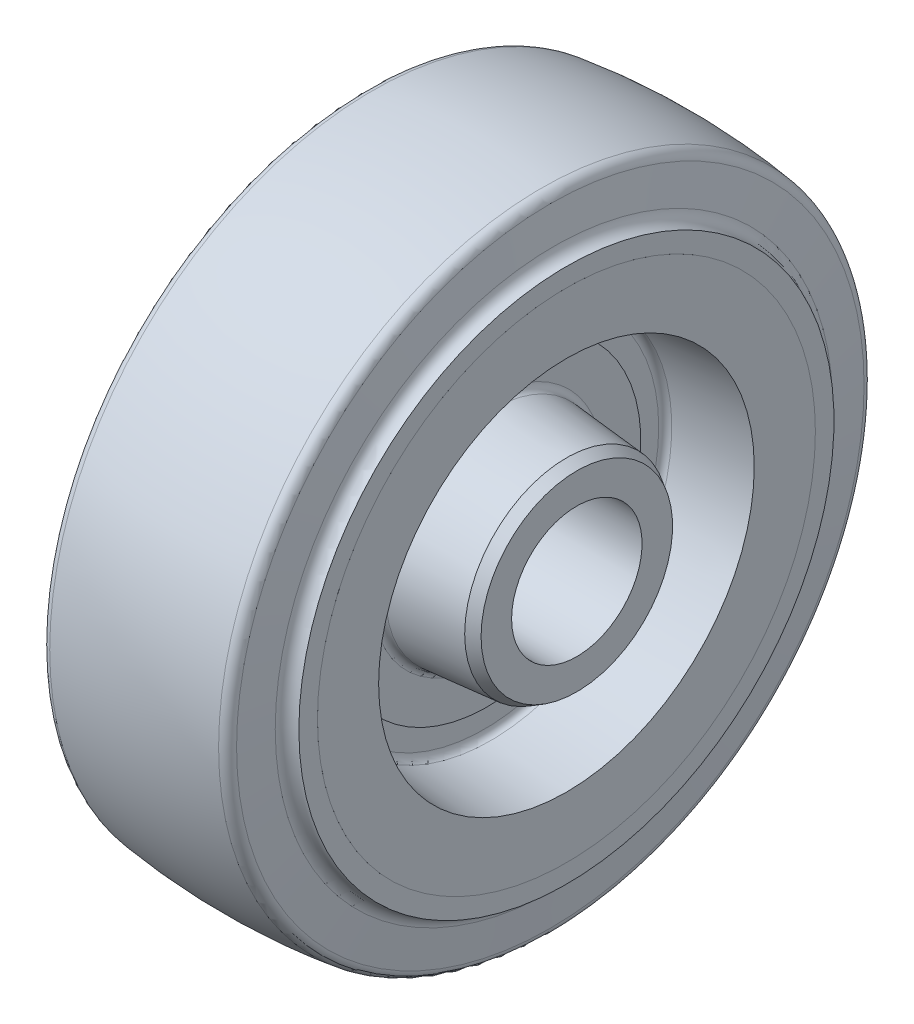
ISO-10303-21;
HEADER;
FILE_DESCRIPTION(('STEP AP214'),'2;1');
FILE_NAME('part.step','',(''),(''),'','','');
FILE_SCHEMA(('AUTOMOTIVE_DESIGN { 1 0 10303 214 1 1 1 1 }'));
ENDSEC;
DATA;
#1=APPLICATION_CONTEXT('core data for automotive mechanical design processes');
#2=APPLICATION_PROTOCOL_DEFINITION('international standard','automotive_design',2000,#1);
#3=PRODUCT_CONTEXT('',#1,'mechanical');
#4=PRODUCT('Part','Part','',(#3));
#5=PRODUCT_RELATED_PRODUCT_CATEGORY('part','',(#4));
#6=PRODUCT_DEFINITION_FORMATION('','',#4);
#7=PRODUCT_DEFINITION_CONTEXT('part definition',#1,'design');
#8=PRODUCT_DEFINITION('design','',#6,#7);
#9=PRODUCT_DEFINITION_SHAPE('','',#8);
#10=(LENGTH_UNIT() NAMED_UNIT(*) SI_UNIT(.MILLI.,.METRE.));
#11=(NAMED_UNIT(*) PLANE_ANGLE_UNIT() SI_UNIT($,.RADIAN.));
#12=(NAMED_UNIT(*) SI_UNIT($,.STERADIAN.) SOLID_ANGLE_UNIT());
#13=UNCERTAINTY_MEASURE_WITH_UNIT(LENGTH_MEASURE(1.E-05),#10,'distance_accuracy_value','');
#14=(GEOMETRIC_REPRESENTATION_CONTEXT(3) GLOBAL_UNCERTAINTY_ASSIGNED_CONTEXT((#13)) GLOBAL_UNIT_ASSIGNED_CONTEXT((#10,
#11,#12)) REPRESENTATION_CONTEXT('',''));
#15=CARTESIAN_POINT('',(0.,0.,0.));
#16=DIRECTION('',(0.,0.,1.));
#17=DIRECTION('',(1.,0.,0.));
#18=AXIS2_PLACEMENT_3D('',#15,#16,#17);
#19=CARTESIAN_POINT('',(25.4,0.,0.));
#20=DIRECTION('',(-1.,0.,0.));
#21=DIRECTION('',(0.,0.,1.));
#22=AXIS2_PLACEMENT_3D('',#19,#20,#21);
#23=CONICAL_SURFACE('',#22,23.618146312,0.0872664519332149);
#24=CARTESIAN_POINT('',(8.56114027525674,0.,0.));
#25=DIRECTION('',(-1.,0.,0.));
#26=DIRECTION('',(0.,0.,1.));
#27=AXIS2_PLACEMENT_3D('',#24,#25,#26);
#28=CIRCLE('',#27,25.0913554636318);
#29=CARTESIAN_POINT('',(8.56114027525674,0.,25.0913554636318));
#30=VERTEX_POINT('',#29);
#31=EDGE_CURVE('E10',#30,#30,#28,.T.);
#32=ORIENTED_EDGE('',*,*,#31,.F.);
#33=EDGE_LOOP('',(#32));
#34=FACE_BOUND('',#33,.T.);
#35=CARTESIAN_POINT('',(25.4,0.,0.));
#36=DIRECTION('',(-1.,0.,0.));
#37=DIRECTION('',(0.,0.,1.));
#38=AXIS2_PLACEMENT_3D('',#35,#36,#37);
#39=CIRCLE('',#38,23.618146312);
#40=CARTESIAN_POINT('',(25.4,0.,23.618146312));
#41=VERTEX_POINT('',#40);
#42=EDGE_CURVE('E460',#41,#41,#39,.T.);
#43=ORIENTED_EDGE('',*,*,#42,.T.);
#44=EDGE_LOOP('',(#43));
#45=FACE_BOUND('',#44,.T.);
#46=ADVANCED_FACE('F360',(#34,#45),#23,.T.);
#47=CARTESIAN_POINT('',(8.6995,0.,0.));
#48=DIRECTION('',(-1.,0.,0.));
#49=DIRECTION('',(0.,0.,1.));
#50=AXIS2_PLACEMENT_3D('',#47,#48,#49);
#51=TOROIDAL_SURFACE('',#50,26.6728145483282,1.5875);
#52=CARTESIAN_POINT('',(7.112,0.,0.));
#53=DIRECTION('',(-1.,0.,0.));
#54=DIRECTION('',(0.,0.,1.));
#55=AXIS2_PLACEMENT_3D('',#52,#53,#54);
#56=CIRCLE('',#55,26.6728145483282);
#57=CARTESIAN_POINT('',(7.112,0.,26.6728145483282));
#58=VERTEX_POINT('',#57);
#59=EDGE_CURVE('E366',#58,#58,#56,.T.);
#60=ORIENTED_EDGE('',*,*,#59,.F.);
#61=EDGE_LOOP('',(#60));
#62=FACE_BOUND('',#61,.T.);
#63=ORIENTED_EDGE('',*,*,#31,.T.);
#64=EDGE_LOOP('',(#63));
#65=FACE_BOUND('',#64,.T.);
#66=ADVANCED_FACE('F641',(#62,#65),#51,.F.);
#67=CARTESIAN_POINT('',(7.112,35.56,0.));
#68=DIRECTION('',(-1.,0.,0.));
#69=DIRECTION('',(0.,0.,1.));
#70=AXIS2_PLACEMENT_3D('',#67,#68,#69);
#71=PLANE('',#70);
#72=CARTESIAN_POINT('',(7.112,0.,0.));
#73=DIRECTION('',(-1.,0.,0.));
#74=DIRECTION('',(0.,0.,1.));
#75=AXIS2_PLACEMENT_3D('',#72,#73,#74);
#76=CIRCLE('',#75,35.56);
#77=CARTESIAN_POINT('',(7.112,0.,35.56));
#78=VERTEX_POINT('',#77);
#79=EDGE_CURVE('E370',#78,#78,#76,.T.);
#80=ORIENTED_EDGE('',*,*,#79,.F.);
#81=EDGE_LOOP('',(#80));
#82=FACE_BOUND('',#81,.T.);
#83=ORIENTED_EDGE('',*,*,#59,.T.);
#84=EDGE_LOOP('',(#83));
#85=FACE_BOUND('',#84,.T.);
#86=ADVANCED_FACE('F636',(#82,#85),#71,.F.);
#87=CARTESIAN_POINT('',(-38.862204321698,0.,0.));
#88=DIRECTION('',(-1.,0.,0.));
#89=DIRECTION('',(0.,0.,1.));
#90=AXIS2_PLACEMENT_3D('',#87,#88,#89);
#91=CYLINDRICAL_SURFACE('',#90,35.56);
#92=CARTESIAN_POINT('',(6.35,0.,0.));
#93=DIRECTION('',(-1.,0.,0.));
#94=DIRECTION('',(0.,0.,1.));
#95=AXIS2_PLACEMENT_3D('',#92,#93,#94);
#96=CIRCLE('',#95,35.56);
#97=CARTESIAN_POINT('',(6.35,0.,35.56));
#98=VERTEX_POINT('',#97);
#99=EDGE_CURVE('E374',#98,#98,#96,.T.);
#100=ORIENTED_EDGE('',*,*,#99,.F.);
#101=EDGE_LOOP('',(#100));
#102=FACE_BOUND('',#101,.T.);
#103=ORIENTED_EDGE('',*,*,#79,.T.);
#104=EDGE_LOOP('',(#103));
#105=FACE_BOUND('',#104,.T.);
#106=ADVANCED_FACE('F630',(#102,#105),#91,.T.);
#107=CARTESIAN_POINT('',(6.35,40.4707588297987,0.));
#108=DIRECTION('',(-1.,0.,0.));
#109=DIRECTION('',(0.,0.,1.));
#110=AXIS2_PLACEMENT_3D('',#107,#108,#109);
#111=PLANE('',#110);
#112=CARTESIAN_POINT('',(6.35,0.,0.));
#113=DIRECTION('',(-1.,0.,0.));
#114=DIRECTION('',(0.,0.,1.));
#115=AXIS2_PLACEMENT_3D('',#112,#113,#114);
#116=CIRCLE('',#115,40.4707588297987);
#117=CARTESIAN_POINT('',(6.35,0.,40.4707588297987));
#118=VERTEX_POINT('',#117);
#119=EDGE_CURVE('E379',#118,#118,#116,.T.);
#120=ORIENTED_EDGE('',*,*,#119,.F.);
#121=EDGE_LOOP('',(#120));
#122=FACE_BOUND('',#121,.T.);
#123=ORIENTED_EDGE('',*,*,#99,.T.);
#124=EDGE_LOOP('',(#123));
#125=FACE_BOUND('',#124,.T.);
#126=ADVANCED_FACE('F624',(#122,#125),#111,.F.);
#127=CARTESIAN_POINT('',(7.9375,0.,0.));
#128=DIRECTION('',(-1.,0.,0.));
#129=DIRECTION('',(0.,0.,1.));
#130=AXIS2_PLACEMENT_3D('',#127,#128,#129);
#131=TOROIDAL_SURFACE('',#130,40.4707588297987,1.5875);
#132=CARTESIAN_POINT('',(7.79914025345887,0.,0.));
#133=DIRECTION('',(-1.,0.,0.));
#134=DIRECTION('',(0.,0.,1.));
#135=AXIS2_PLACEMENT_3D('',#132,#133,#134);
#136=CIRCLE('',#135,42.0522179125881);
#137=CARTESIAN_POINT('',(7.79914025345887,0.,42.0522179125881));
#138=VERTEX_POINT('',#137);
#139=EDGE_CURVE('E382',#138,#138,#136,.T.);
#140=ORIENTED_EDGE('',*,*,#139,.F.);
#141=EDGE_LOOP('',(#140));
#142=FACE_BOUND('',#141,.T.);
#143=ORIENTED_EDGE('',*,*,#119,.T.);
#144=EDGE_LOOP('',(#143));
#145=FACE_BOUND('',#144,.T.);
#146=ADVANCED_FACE('F618',(#142,#145),#131,.F.);
#147=CARTESIAN_POINT('',(7.79914025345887,0.,0.));
#148=DIRECTION('',(1.,0.,0.));
#149=DIRECTION('',(0.,0.,-1.));
#150=AXIS2_PLACEMENT_3D('',#147,#148,#149);
#151=CONICAL_SURFACE('',#150,42.0522179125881,0.0872664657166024);
#152=CARTESIAN_POINT('',(25.4,0.,0.));
#153=DIRECTION('',(-1.,0.,0.));
#154=DIRECTION('',(0.,0.,1.));
#155=AXIS2_PLACEMENT_3D('',#152,#153,#154);
#156=CIRCLE('',#155,43.592093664);
#157=CARTESIAN_POINT('',(25.4,0.,43.592093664));
#158=VERTEX_POINT('',#157);
#159=EDGE_CURVE('E385',#158,#158,#156,.T.);
#160=ORIENTED_EDGE('',*,*,#159,.F.);
#161=EDGE_LOOP('',(#160));
#162=FACE_BOUND('',#161,.T.);
#163=ORIENTED_EDGE('',*,*,#139,.T.);
#164=EDGE_LOOP('',(#163));
#165=FACE_BOUND('',#164,.T.);
#166=ADVANCED_FACE('F612',(#162,#165),#151,.F.);
#167=CARTESIAN_POINT('',(25.4,43.592093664,0.));
#168=DIRECTION('',(-1.,0.,0.));
#169=DIRECTION('',(0.,0.,1.));
#170=AXIS2_PLACEMENT_3D('',#167,#168,#169);
#171=PLANE('',#170);
#172=CARTESIAN_POINT('',(25.4,0.,0.));
#173=DIRECTION('',(-1.,0.,0.));
#174=DIRECTION('',(0.,0.,1.));
#175=AXIS2_PLACEMENT_3D('',#172,#173,#174);
#176=CIRCLE('',#175,57.785);
#177=CARTESIAN_POINT('',(25.4,0.,57.785));
#178=VERTEX_POINT('',#177);
#179=EDGE_CURVE('E388',#178,#178,#176,.T.);
#180=ORIENTED_EDGE('',*,*,#179,.F.);
#181=EDGE_LOOP('',(#180));
#182=FACE_BOUND('',#181,.T.);
#183=ORIENTED_EDGE('',*,*,#159,.T.);
#184=EDGE_LOOP('',(#183));
#185=FACE_BOUND('',#184,.T.);
#186=ADVANCED_FACE('F606',(#182,#185),#171,.F.);
#187=CARTESIAN_POINT('',(-38.862204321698,0.,0.));
#188=DIRECTION('',(-1.,0.,0.));
#189=DIRECTION('',(0.,0.,1.));
#190=AXIS2_PLACEMENT_3D('',#187,#188,#189);
#191=CYLINDRICAL_SURFACE('',#190,57.785);
#192=CARTESIAN_POINT('',(25.39746,0.,0.));
#193=DIRECTION('',(-1.,0.,0.));
#194=DIRECTION('',(0.,0.,1.));
#195=AXIS2_PLACEMENT_3D('',#192,#193,#194);
#196=CIRCLE('',#195,57.785);
#197=CARTESIAN_POINT('',(25.39746,0.,57.785));
#198=VERTEX_POINT('',#197);
#199=EDGE_CURVE('E391',#198,#198,#196,.T.);
#200=ORIENTED_EDGE('',*,*,#199,.F.);
#201=EDGE_LOOP('',(#200));
#202=FACE_BOUND('',#201,.T.);
#203=ORIENTED_EDGE('',*,*,#179,.T.);
#204=EDGE_LOOP('',(#203));
#205=FACE_BOUND('',#204,.T.);
#206=ADVANCED_FACE('F600',(#202,#205),#191,.T.);
#207=CARTESIAN_POINT('',(25.39746,57.785,0.));
#208=DIRECTION('',(-1.,0.,0.));
#209=DIRECTION('',(0.,0.,1.));
#210=AXIS2_PLACEMENT_3D('',#207,#208,#209);
#211=PLANE('',#210);
#212=CARTESIAN_POINT('',(25.39746,0.,0.));
#213=DIRECTION('',(-1.,0.,0.));
#214=DIRECTION('',(0.,0.,1.));
#215=AXIS2_PLACEMENT_3D('',#212,#213,#214);
#216=CIRCLE('',#215,62.103);
#217=CARTESIAN_POINT('',(25.39746,0.,62.103));
#218=VERTEX_POINT('',#217);
#219=EDGE_CURVE('E394',#218,#218,#216,.T.);
#220=ORIENTED_EDGE('',*,*,#219,.F.);
#221=EDGE_LOOP('',(#220));
#222=FACE_BOUND('',#221,.T.);
#223=ORIENTED_EDGE('',*,*,#199,.T.);
#224=EDGE_LOOP('',(#223));
#225=FACE_BOUND('',#224,.T.);
#226=ADVANCED_FACE('F594',(#222,#225),#211,.F.);
#227=CARTESIAN_POINT('',(25.39746,0.,0.));
#228=DIRECTION('',(-1.,0.,0.));
#229=DIRECTION('',(0.,0.,1.));
#230=AXIS2_PLACEMENT_3D('',#227,#228,#229);
#231=TOROIDAL_SURFACE('',#230,65.0044204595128,2.90142045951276);
#232=CARTESIAN_POINT('',(22.5119338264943,0.,0.));
#233=DIRECTION('',(-1.,0.,0.));
#234=DIRECTION('',(0.,0.,1.));
#235=AXIS2_PLACEMENT_3D('',#232,#233,#234);
#236=CIRCLE('',#235,64.7011394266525);
#237=CARTESIAN_POINT('',(22.5119338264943,0.,64.7011394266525));
#238=VERTEX_POINT('',#237);
#239=EDGE_CURVE('E397',#238,#238,#236,.T.);
#240=ORIENTED_EDGE('',*,*,#239,.F.);
#241=EDGE_LOOP('',(#240));
#242=FACE_BOUND('',#241,.T.);
#243=ORIENTED_EDGE('',*,*,#219,.T.);
#244=EDGE_LOOP('',(#243));
#245=FACE_BOUND('',#244,.T.);
#246=ADVANCED_FACE('F588',(#242,#245),#231,.F.);
#247=CARTESIAN_POINT('',(22.5119338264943,0.,0.));
#248=DIRECTION('',(-1.,0.,0.));
#249=DIRECTION('',(0.,0.,1.));
#250=AXIS2_PLACEMENT_3D('',#247,#248,#249);
#251=CONICAL_SURFACE('',#250,64.7011394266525,1.46607656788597);
#252=CARTESIAN_POINT('',(21.6583679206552,0.,0.));
#253=DIRECTION('',(-1.,0.,0.));
#254=DIRECTION('',(0.,0.,1.));
#255=AXIS2_PLACEMENT_3D('',#252,#253,#254);
#256=CIRCLE('',#255,72.822276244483);
#257=CARTESIAN_POINT('',(21.6583679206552,0.,72.822276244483));
#258=VERTEX_POINT('',#257);
#259=EDGE_CURVE('E400',#258,#258,#256,.T.);
#260=ORIENTED_EDGE('',*,*,#259,.F.);
#261=EDGE_LOOP('',(#260));
#262=FACE_BOUND('',#261,.T.);
#263=ORIENTED_EDGE('',*,*,#239,.T.);
#264=EDGE_LOOP('',(#263));
#265=FACE_BOUND('',#264,.T.);
#266=ADVANCED_FACE('F582',(#262,#265),#251,.T.);
#267=CARTESIAN_POINT('',(19.2901626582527,0.,0.));
#268=DIRECTION('',(-1.,0.,0.));
#269=DIRECTION('',(0.,0.,1.));
#270=AXIS2_PLACEMENT_3D('',#267,#268,#269);
#271=TOROIDAL_SURFACE('',#270,72.5733678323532,2.38125);
#272=CARTESIAN_POINT('',(19.5963557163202,0.,0.));
#273=DIRECTION('',(-1.,0.,0.));
#274=DIRECTION('',(0.,0.,1.));
#275=AXIS2_PLACEMENT_3D('',#272,#273,#274);
#276=CIRCLE('',#275,74.9348498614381);
#277=CARTESIAN_POINT('',(19.5963557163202,0.,74.9348498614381));
#278=VERTEX_POINT('',#277);
#279=EDGE_CURVE('E403',#278,#278,#276,.T.);
#280=ORIENTED_EDGE('',*,*,#279,.F.);
#281=EDGE_LOOP('',(#280));
#282=FACE_BOUND('',#281,.T.);
#283=ORIENTED_EDGE('',*,*,#259,.T.);
#284=EDGE_LOOP('',(#283));
#285=FACE_BOUND('',#284,.T.);
#286=ADVANCED_FACE('F576',(#282,#285),#271,.T.);
#287=CARTESIAN_POINT('',(0.,0.,0.));
#288=DIRECTION('',(-1.,0.,0.));
#289=DIRECTION('',(0.,0.,1.));
#290=AXIS2_PLACEMENT_3D('',#287,#288,#289);
#291=DEGENERATE_TOROIDAL_SURFACE('',#290,76.2,152.4,.F.);
#292=CARTESIAN_POINT('',(-19.5963557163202,0.,0.));
#293=DIRECTION('',(-1.,0.,0.));
#294=DIRECTION('',(0.,0.,1.));
#295=AXIS2_PLACEMENT_3D('',#292,#293,#294);
#296=CIRCLE('',#295,74.9348498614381);
#297=CARTESIAN_POINT('',(-19.5963557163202,0.,74.9348498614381));
#298=VERTEX_POINT('',#297);
#299=EDGE_CURVE('E406',#298,#298,#296,.T.);
#300=ORIENTED_EDGE('',*,*,#299,.F.);
#301=EDGE_LOOP('',(#300));
#302=FACE_BOUND('',#301,.T.);
#303=ORIENTED_EDGE('',*,*,#279,.T.);
#304=EDGE_LOOP('',(#303));
#305=FACE_BOUND('',#304,.T.);
#306=ADVANCED_FACE('F570',(#302,#305),#291,.F.);
#307=CARTESIAN_POINT('',(-19.2901626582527,0.,0.));
#308=DIRECTION('',(-1.,0.,0.));
#309=DIRECTION('',(0.,0.,1.));
#310=AXIS2_PLACEMENT_3D('',#307,#308,#309);
#311=TOROIDAL_SURFACE('',#310,72.5733678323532,2.38124999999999);
#312=CARTESIAN_POINT('',(-21.6583679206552,0.,0.));
#313=DIRECTION('',(-1.,0.,0.));
#314=DIRECTION('',(0.,0.,1.));
#315=AXIS2_PLACEMENT_3D('',#312,#313,#314);
#316=CIRCLE('',#315,72.822276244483);
#317=CARTESIAN_POINT('',(-21.6583679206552,0.,72.822276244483));
#318=VERTEX_POINT('',#317);
#319=EDGE_CURVE('E409',#318,#318,#316,.T.);
#320=ORIENTED_EDGE('',*,*,#319,.F.);
#321=EDGE_LOOP('',(#320));
#322=FACE_BOUND('',#321,.T.);
#323=ORIENTED_EDGE('',*,*,#299,.T.);
#324=EDGE_LOOP('',(#323));
#325=FACE_BOUND('',#324,.T.);
#326=ADVANCED_FACE('F564',(#322,#325),#311,.T.);
#327=CARTESIAN_POINT('',(-21.6583679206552,0.,0.));
#328=DIRECTION('',(1.,0.,0.));
#329=DIRECTION('',(0.,0.,-1.));
#330=AXIS2_PLACEMENT_3D('',#327,#328,#329);
#331=CONICAL_SURFACE('',#330,72.822276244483,1.46607656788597);
#332=CARTESIAN_POINT('',(-22.5119338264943,0.,0.));
#333=DIRECTION('',(-1.,0.,0.));
#334=DIRECTION('',(0.,0.,1.));
#335=AXIS2_PLACEMENT_3D('',#332,#333,#334);
#336=CIRCLE('',#335,64.7011394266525);
#337=CARTESIAN_POINT('',(-22.5119338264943,0.,64.7011394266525));
#338=VERTEX_POINT('',#337);
#339=EDGE_CURVE('E412',#338,#338,#336,.T.);
#340=ORIENTED_EDGE('',*,*,#339,.F.);
#341=EDGE_LOOP('',(#340));
#342=FACE_BOUND('',#341,.T.);
#343=ORIENTED_EDGE('',*,*,#319,.T.);
#344=EDGE_LOOP('',(#343));
#345=FACE_BOUND('',#344,.T.);
#346=ADVANCED_FACE('F558',(#342,#345),#331,.T.);
#347=CARTESIAN_POINT('',(-25.39746,0.,0.));
#348=DIRECTION('',(-1.,0.,0.));
#349=DIRECTION('',(0.,0.,1.));
#350=AXIS2_PLACEMENT_3D('',#347,#348,#349);
#351=TOROIDAL_SURFACE('',#350,65.0044204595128,2.90142045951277);
#352=CARTESIAN_POINT('',(-25.39746,0.,0.));
#353=DIRECTION('',(-1.,0.,0.));
#354=DIRECTION('',(0.,0.,1.));
#355=AXIS2_PLACEMENT_3D('',#352,#353,#354);
#356=CIRCLE('',#355,62.103);
#357=CARTESIAN_POINT('',(-25.39746,0.,62.103));
#358=VERTEX_POINT('',#357);
#359=EDGE_CURVE('E415',#358,#358,#356,.T.);
#360=ORIENTED_EDGE('',*,*,#359,.F.);
#361=EDGE_LOOP('',(#360));
#362=FACE_BOUND('',#361,.T.);
#363=ORIENTED_EDGE('',*,*,#339,.T.);
#364=EDGE_LOOP('',(#363));
#365=FACE_BOUND('',#364,.T.);
#366=ADVANCED_FACE('F552',(#362,#365),#351,.F.);
#367=CARTESIAN_POINT('',(-25.39746,62.103,0.));
#368=DIRECTION('',(1.,0.,0.));
#369=DIRECTION('',(0.,0.,-1.));
#370=AXIS2_PLACEMENT_3D('',#367,#368,#369);
#371=PLANE('',#370);
#372=CARTESIAN_POINT('',(-25.39746,0.,0.));
#373=DIRECTION('',(-1.,0.,0.));
#374=DIRECTION('',(0.,0.,1.));
#375=AXIS2_PLACEMENT_3D('',#372,#373,#374);
#376=CIRCLE('',#375,57.785);
#377=CARTESIAN_POINT('',(-25.39746,0.,57.785));
#378=VERTEX_POINT('',#377);
#379=EDGE_CURVE('E418',#378,#378,#376,.T.);
#380=ORIENTED_EDGE('',*,*,#379,.F.);
#381=EDGE_LOOP('',(#380));
#382=FACE_BOUND('',#381,.T.);
#383=ORIENTED_EDGE('',*,*,#359,.T.);
#384=EDGE_LOOP('',(#383));
#385=FACE_BOUND('',#384,.T.);
#386=ADVANCED_FACE('F546',(#382,#385),#371,.F.);
#387=CARTESIAN_POINT('',(-38.862204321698,0.,0.));
#388=DIRECTION('',(-1.,0.,0.));
#389=DIRECTION('',(0.,0.,1.));
#390=AXIS2_PLACEMENT_3D('',#387,#388,#389);
#391=CYLINDRICAL_SURFACE('',#390,57.785);
#392=CARTESIAN_POINT('',(-25.4,0.,0.));
#393=DIRECTION('',(-1.,0.,0.));
#394=DIRECTION('',(0.,0.,1.));
#395=AXIS2_PLACEMENT_3D('',#392,#393,#394);
#396=CIRCLE('',#395,57.785);
#397=CARTESIAN_POINT('',(-25.4,0.,57.785));
#398=VERTEX_POINT('',#397);
#399=EDGE_CURVE('E421',#398,#398,#396,.T.);
#400=ORIENTED_EDGE('',*,*,#399,.F.);
#401=EDGE_LOOP('',(#400));
#402=FACE_BOUND('',#401,.T.);
#403=ORIENTED_EDGE('',*,*,#379,.T.);
#404=EDGE_LOOP('',(#403));
#405=FACE_BOUND('',#404,.T.);
#406=ADVANCED_FACE('F540',(#402,#405),#391,.T.);
#407=CARTESIAN_POINT('',(-25.4,57.785,0.));
#408=DIRECTION('',(1.,0.,0.));
#409=DIRECTION('',(0.,0.,-1.));
#410=AXIS2_PLACEMENT_3D('',#407,#408,#409);
#411=PLANE('',#410);
#412=CARTESIAN_POINT('',(-25.4,0.,0.));
#413=DIRECTION('',(-1.,0.,0.));
#414=DIRECTION('',(0.,0.,1.));
#415=AXIS2_PLACEMENT_3D('',#412,#413,#414);
#416=CIRCLE('',#415,43.592093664);
#417=CARTESIAN_POINT('',(-25.4,0.,43.592093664));
#418=VERTEX_POINT('',#417);
#419=EDGE_CURVE('E424',#418,#418,#416,.T.);
#420=ORIENTED_EDGE('',*,*,#419,.F.);
#421=EDGE_LOOP('',(#420));
#422=FACE_BOUND('',#421,.T.);
#423=ORIENTED_EDGE('',*,*,#399,.T.);
#424=EDGE_LOOP('',(#423));
#425=FACE_BOUND('',#424,.T.);
#426=ADVANCED_FACE('F534',(#422,#425),#411,.F.);
#427=CARTESIAN_POINT('',(-25.4,0.,0.));
#428=DIRECTION('',(-1.,0.,0.));
#429=DIRECTION('',(0.,0.,1.));
#430=AXIS2_PLACEMENT_3D('',#427,#428,#429);
#431=CONICAL_SURFACE('',#430,43.592093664,0.087266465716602);
#432=CARTESIAN_POINT('',(-7.79914025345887,0.,0.));
#433=DIRECTION('',(-1.,0.,0.));
#434=DIRECTION('',(0.,0.,1.));
#435=AXIS2_PLACEMENT_3D('',#432,#433,#434);
#436=CIRCLE('',#435,42.0522179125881);
#437=CARTESIAN_POINT('',(-7.79914025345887,0.,42.0522179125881));
#438=VERTEX_POINT('',#437);
#439=EDGE_CURVE('E427',#438,#438,#436,.T.);
#440=ORIENTED_EDGE('',*,*,#439,.F.);
#441=EDGE_LOOP('',(#440));
#442=FACE_BOUND('',#441,.T.);
#443=ORIENTED_EDGE('',*,*,#419,.T.);
#444=EDGE_LOOP('',(#443));
#445=FACE_BOUND('',#444,.T.);
#446=ADVANCED_FACE('F528',(#442,#445),#431,.F.);
#447=CARTESIAN_POINT('',(-7.9375,0.,0.));
#448=DIRECTION('',(-1.,0.,0.));
#449=DIRECTION('',(0.,0.,1.));
#450=AXIS2_PLACEMENT_3D('',#447,#448,#449);
#451=TOROIDAL_SURFACE('',#450,40.4707588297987,1.5875);
#452=CARTESIAN_POINT('',(-6.35,0.,0.));
#453=DIRECTION('',(-1.,0.,0.));
#454=DIRECTION('',(0.,0.,1.));
#455=AXIS2_PLACEMENT_3D('',#452,#453,#454);
#456=CIRCLE('',#455,40.4707588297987);
#457=CARTESIAN_POINT('',(-6.35,0.,40.4707588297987));
#458=VERTEX_POINT('',#457);
#459=EDGE_CURVE('E430',#458,#458,#456,.T.);
#460=ORIENTED_EDGE('',*,*,#459,.F.);
#461=EDGE_LOOP('',(#460));
#462=FACE_BOUND('',#461,.T.);
#463=ORIENTED_EDGE('',*,*,#439,.T.);
#464=EDGE_LOOP('',(#463));
#465=FACE_BOUND('',#464,.T.);
#466=ADVANCED_FACE('F522',(#462,#465),#451,.F.);
#467=CARTESIAN_POINT('',(-6.35000000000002,35.56,0.));
#468=DIRECTION('',(1.,0.,0.));
#469=DIRECTION('',(0.,0.,-1.));
#470=AXIS2_PLACEMENT_3D('',#467,#468,#469);
#471=PLANE('',#470);
#472=CARTESIAN_POINT('',(-6.35000000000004,0.,0.));
#473=DIRECTION('',(-1.,0.,0.));
#474=DIRECTION('',(0.,0.,1.));
#475=AXIS2_PLACEMENT_3D('',#472,#473,#474);
#476=CIRCLE('',#475,35.56);
#477=CARTESIAN_POINT('',(-6.35000000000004,0.,35.56));
#478=VERTEX_POINT('',#477);
#479=EDGE_CURVE('E433',#478,#478,#476,.T.);
#480=ORIENTED_EDGE('',*,*,#479,.F.);
#481=EDGE_LOOP('',(#480));
#482=FACE_BOUND('',#481,.T.);
#483=ORIENTED_EDGE('',*,*,#459,.T.);
#484=EDGE_LOOP('',(#483));
#485=FACE_BOUND('',#484,.T.);
#486=ADVANCED_FACE('F516',(#482,#485),#471,.F.);
#487=CARTESIAN_POINT('',(-38.862204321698,0.,0.));
#488=DIRECTION('',(-1.,0.,0.));
#489=DIRECTION('',(0.,0.,1.));
#490=AXIS2_PLACEMENT_3D('',#487,#488,#489);
#491=CYLINDRICAL_SURFACE('',#490,35.56);
#492=CARTESIAN_POINT('',(-7.112,0.,0.));
#493=DIRECTION('',(-1.,0.,0.));
#494=DIRECTION('',(0.,0.,1.));
#495=AXIS2_PLACEMENT_3D('',#492,#493,#494);
#496=CIRCLE('',#495,35.56);
#497=CARTESIAN_POINT('',(-7.112,0.,35.56));
#498=VERTEX_POINT('',#497);
#499=EDGE_CURVE('E436',#498,#498,#496,.T.);
#500=ORIENTED_EDGE('',*,*,#499,.F.);
#501=EDGE_LOOP('',(#500));
#502=FACE_BOUND('',#501,.T.);
#503=ORIENTED_EDGE('',*,*,#479,.T.);
#504=EDGE_LOOP('',(#503));
#505=FACE_BOUND('',#504,.T.);
#506=ADVANCED_FACE('F510',(#502,#505),#491,.T.);
#507=CARTESIAN_POINT('',(-7.112,26.6728145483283,0.));
#508=DIRECTION('',(1.,0.,0.));
#509=DIRECTION('',(0.,0.,-1.));
#510=AXIS2_PLACEMENT_3D('',#507,#508,#509);
#511=PLANE('',#510);
#512=CARTESIAN_POINT('',(-7.112,0.,0.));
#513=DIRECTION('',(-1.,0.,0.));
#514=DIRECTION('',(0.,0.,1.));
#515=AXIS2_PLACEMENT_3D('',#512,#513,#514);
#516=CIRCLE('',#515,26.6728145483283);
#517=CARTESIAN_POINT('',(-7.112,0.,26.6728145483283));
#518=VERTEX_POINT('',#517);
#519=EDGE_CURVE('E439',#518,#518,#516,.T.);
#520=ORIENTED_EDGE('',*,*,#519,.F.);
#521=EDGE_LOOP('',(#520));
#522=FACE_BOUND('',#521,.T.);
#523=ORIENTED_EDGE('',*,*,#499,.T.);
#524=EDGE_LOOP('',(#523));
#525=FACE_BOUND('',#524,.T.);
#526=ADVANCED_FACE('F504',(#522,#525),#511,.F.);
#527=CARTESIAN_POINT('',(-8.6995,0.,0.));
#528=DIRECTION('',(-1.,0.,0.));
#529=DIRECTION('',(0.,0.,1.));
#530=AXIS2_PLACEMENT_3D('',#527,#528,#529);
#531=TOROIDAL_SURFACE('',#530,26.6728145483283,1.5875);
#532=CARTESIAN_POINT('',(-8.56114027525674,0.,0.));
#533=DIRECTION('',(-1.,0.,0.));
#534=DIRECTION('',(0.,0.,1.));
#535=AXIS2_PLACEMENT_3D('',#532,#533,#534);
#536=CIRCLE('',#535,25.0913554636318);
#537=CARTESIAN_POINT('',(-8.56114027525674,0.,25.0913554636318));
#538=VERTEX_POINT('',#537);
#539=EDGE_CURVE('E442',#538,#538,#536,.T.);
#540=ORIENTED_EDGE('',*,*,#539,.F.);
#541=EDGE_LOOP('',(#540));
#542=FACE_BOUND('',#541,.T.);
#543=ORIENTED_EDGE('',*,*,#519,.T.);
#544=EDGE_LOOP('',(#543));
#545=FACE_BOUND('',#544,.T.);
#546=ADVANCED_FACE('F498',(#542,#545),#531,.F.);
#547=CARTESIAN_POINT('',(-8.56114027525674,0.,0.));
#548=DIRECTION('',(1.,0.,0.));
#549=DIRECTION('',(0.,0.,-1.));
#550=AXIS2_PLACEMENT_3D('',#547,#548,#549);
#551=CONICAL_SURFACE('',#550,25.0913554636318,0.0872664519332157);
#552=CARTESIAN_POINT('',(-25.4,0.,0.));
#553=DIRECTION('',(-1.,0.,0.));
#554=DIRECTION('',(0.,0.,1.));
#555=AXIS2_PLACEMENT_3D('',#552,#553,#554);
#556=CIRCLE('',#555,23.618146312);
#557=CARTESIAN_POINT('',(-25.4,0.,23.618146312));
#558=VERTEX_POINT('',#557);
#559=EDGE_CURVE('E445',#558,#558,#556,.T.);
#560=ORIENTED_EDGE('',*,*,#559,.F.);
#561=EDGE_LOOP('',(#560));
#562=FACE_BOUND('',#561,.T.);
#563=ORIENTED_EDGE('',*,*,#539,.T.);
#564=EDGE_LOOP('',(#563));
#565=FACE_BOUND('',#564,.T.);
#566=ADVANCED_FACE('F492',(#562,#565),#551,.T.);
#567=CARTESIAN_POINT('',(-25.4,0.,0.));
#568=DIRECTION('',(1.,0.,0.));
#569=DIRECTION('',(0.,0.,-1.));
#570=AXIS2_PLACEMENT_3D('',#567,#568,#569);
#571=CONICAL_SURFACE('',#570,23.618146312,0.523598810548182);
#572=CARTESIAN_POINT('',(-27.813,0.,0.));
#573=DIRECTION('',(-1.,0.,0.));
#574=DIRECTION('',(0.,0.,1.));
#575=AXIS2_PLACEMENT_3D('',#572,#573,#574);
#576=CIRCLE('',#575,22.225);
#577=CARTESIAN_POINT('',(-27.813,0.,22.225));
#578=VERTEX_POINT('',#577);
#579=EDGE_CURVE('E448',#578,#578,#576,.T.);
#580=ORIENTED_EDGE('',*,*,#579,.F.);
#581=EDGE_LOOP('',(#580));
#582=FACE_BOUND('',#581,.T.);
#583=ORIENTED_EDGE('',*,*,#559,.T.);
#584=EDGE_LOOP('',(#583));
#585=FACE_BOUND('',#584,.T.);
#586=ADVANCED_FACE('F486',(#582,#585),#571,.T.);
#587=CARTESIAN_POINT('',(-27.813,15.1384,0.));
#588=DIRECTION('',(1.,0.,0.));
#589=DIRECTION('',(0.,0.,-1.));
#590=AXIS2_PLACEMENT_3D('',#587,#588,#589);
#591=PLANE('',#590);
#592=CARTESIAN_POINT('',(-27.813,0.,0.));
#593=DIRECTION('',(-1.,0.,0.));
#594=DIRECTION('',(0.,0.,1.));
#595=AXIS2_PLACEMENT_3D('',#592,#593,#594);
#596=CIRCLE('',#595,15.1384);
#597=CARTESIAN_POINT('',(-27.813,0.,15.1384));
#598=VERTEX_POINT('',#597);
#599=EDGE_CURVE('E451',#598,#598,#596,.T.);
#600=ORIENTED_EDGE('',*,*,#599,.F.);
#601=EDGE_LOOP('',(#600));
#602=FACE_BOUND('',#601,.T.);
#603=ORIENTED_EDGE('',*,*,#579,.T.);
#604=EDGE_LOOP('',(#603));
#605=FACE_BOUND('',#604,.T.);
#606=ADVANCED_FACE('F480',(#602,#605),#591,.F.);
#607=CARTESIAN_POINT('',(-38.862204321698,0.,0.));
#608=DIRECTION('',(-1.,0.,0.));
#609=DIRECTION('',(0.,0.,1.));
#610=AXIS2_PLACEMENT_3D('',#607,#608,#609);
#611=CYLINDRICAL_SURFACE('',#610,15.1384);
#612=CARTESIAN_POINT('',(27.813,0.,0.));
#613=DIRECTION('',(-1.,0.,0.));
#614=DIRECTION('',(0.,0.,1.));
#615=AXIS2_PLACEMENT_3D('',#612,#613,#614);
#616=CIRCLE('',#615,15.1384);
#617=CARTESIAN_POINT('',(27.813,0.,15.1384));
#618=VERTEX_POINT('',#617);
#619=EDGE_CURVE('E454',#618,#618,#616,.T.);
#620=ORIENTED_EDGE('',*,*,#619,.F.);
#621=EDGE_LOOP('',(#620));
#622=FACE_BOUND('',#621,.T.);
#623=ORIENTED_EDGE('',*,*,#599,.T.);
#624=EDGE_LOOP('',(#623));
#625=FACE_BOUND('',#624,.T.);
#626=ADVANCED_FACE('F474',(#622,#625),#611,.F.);
#627=CARTESIAN_POINT('',(27.813,22.225,0.));
#628=DIRECTION('',(-1.,0.,0.));
#629=DIRECTION('',(0.,0.,1.));
#630=AXIS2_PLACEMENT_3D('',#627,#628,#629);
#631=PLANE('',#630);
#632=CARTESIAN_POINT('',(27.813,0.,0.));
#633=DIRECTION('',(-1.,0.,0.));
#634=DIRECTION('',(0.,0.,1.));
#635=AXIS2_PLACEMENT_3D('',#632,#633,#634);
#636=CIRCLE('',#635,22.225);
#637=CARTESIAN_POINT('',(27.813,0.,22.225));
#638=VERTEX_POINT('',#637);
#639=EDGE_CURVE('E457',#638,#638,#636,.T.);
#640=ORIENTED_EDGE('',*,*,#639,.F.);
#641=EDGE_LOOP('',(#640));
#642=FACE_BOUND('',#641,.T.);
#643=ORIENTED_EDGE('',*,*,#619,.T.);
#644=EDGE_LOOP('',(#643));
#645=FACE_BOUND('',#644,.T.);
#646=ADVANCED_FACE('F468',(#642,#645),#631,.F.);
#647=CARTESIAN_POINT('',(27.813,0.,0.));
#648=DIRECTION('',(-1.,0.,0.));
#649=DIRECTION('',(0.,0.,1.));
#650=AXIS2_PLACEMENT_3D('',#647,#648,#649);
#651=CONICAL_SURFACE('',#650,22.225,0.523598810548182);
#652=ORIENTED_EDGE('',*,*,#42,.F.);
#653=EDGE_LOOP('',(#652));
#654=FACE_BOUND('',#653,.T.);
#655=ORIENTED_EDGE('',*,*,#639,.T.);
#656=EDGE_LOOP('',(#655));
#657=FACE_BOUND('',#656,.T.);
#658=ADVANCED_FACE('F465',(#654,#657),#651,.T.);
#659=CLOSED_SHELL('',(#46,#66,#86,#106,#126,#146,#166,#186,#206,#226,#246,#266,#286,#306,#326,
#346,#366,#386,#406,#426,#446,#466,#486,#506,#526,#546,#566,#586,#606,#626,#646,#658));
#660=MANIFOLD_SOLID_BREP('B2',#659);
#661=ADVANCED_BREP_SHAPE_REPRESENTATION('',(#18,#660),#14);
#662=SHAPE_DEFINITION_REPRESENTATION(#9,#661);
ENDSEC;
END-ISO-10303-21;
